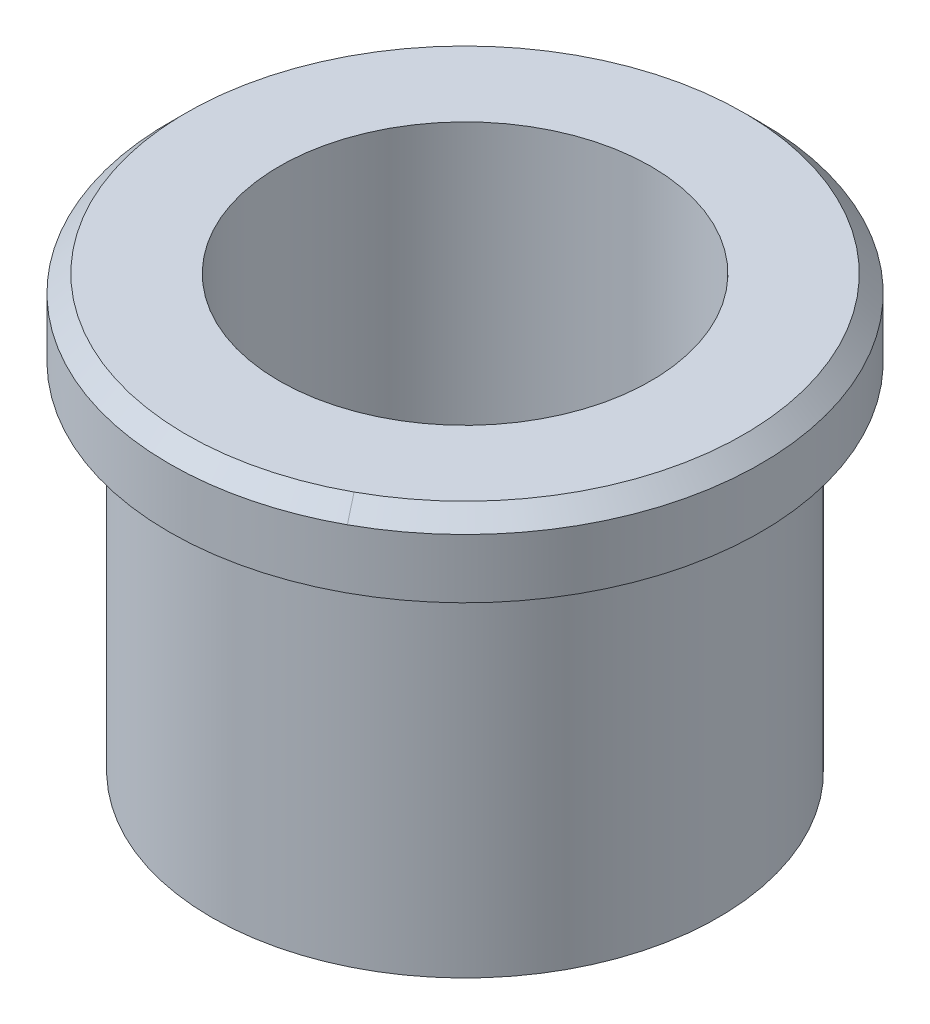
ISO-10303-21;
HEADER;
FILE_DESCRIPTION(('STEP AP214'),'2;1');
FILE_NAME('part.step','',(''),(''),'','','');
FILE_SCHEMA(('AUTOMOTIVE_DESIGN { 1 0 10303 214 1 1 1 1 }'));
ENDSEC;
DATA;
#1=APPLICATION_CONTEXT('core data for automotive mechanical design processes');
#2=APPLICATION_PROTOCOL_DEFINITION('international standard','automotive_design',2000,#1);
#3=PRODUCT_CONTEXT('',#1,'mechanical');
#4=PRODUCT('Part','Part','',(#3));
#5=PRODUCT_RELATED_PRODUCT_CATEGORY('part','',(#4));
#6=PRODUCT_DEFINITION_FORMATION('','',#4);
#7=PRODUCT_DEFINITION_CONTEXT('part definition',#1,'design');
#8=PRODUCT_DEFINITION('design','',#6,#7);
#9=PRODUCT_DEFINITION_SHAPE('','',#8);
#10=(LENGTH_UNIT() NAMED_UNIT(*) SI_UNIT(.MILLI.,.METRE.));
#11=(NAMED_UNIT(*) PLANE_ANGLE_UNIT() SI_UNIT($,.RADIAN.));
#12=(NAMED_UNIT(*) SI_UNIT($,.STERADIAN.) SOLID_ANGLE_UNIT());
#13=UNCERTAINTY_MEASURE_WITH_UNIT(LENGTH_MEASURE(1.E-05),#10,'distance_accuracy_value','');
#14=(GEOMETRIC_REPRESENTATION_CONTEXT(3) GLOBAL_UNCERTAINTY_ASSIGNED_CONTEXT((#13)) GLOBAL_UNIT_ASSIGNED_CONTEXT((#10,
#11,#12)) REPRESENTATION_CONTEXT('',''));
#15=CARTESIAN_POINT('',(0.,0.,0.));
#16=DIRECTION('',(0.,0.,1.));
#17=DIRECTION('',(1.,0.,0.));
#18=AXIS2_PLACEMENT_3D('',#15,#16,#17);
#19=CARTESIAN_POINT('',(0.,-1.00000000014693,0.));
#20=DIRECTION('',(0.,-1.,0.));
#21=DIRECTION('',(1.,0.,0.));
#22=AXIS2_PLACEMENT_3D('',#19,#20,#21);
#23=CONICAL_SURFACE('',#22,17.5000000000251,0.785398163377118);
#24=DIRECTION('',(-0.339005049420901,0.707106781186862,-0.620544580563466));
#25=VECTOR('',#24,1.);
#26=CARTESIAN_POINT('',(239241.254284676,-499000.,437928.178495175));
#27=LINE('',#26,#25);
#28=CARTESIAN_POINT('',(7.91052138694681,4.68652894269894E-11,14.4801122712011));
#29=VERTEX_POINT('',#28);
#30=CARTESIAN_POINT('',(8.38994692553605,-0.999999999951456,15.357694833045));
#31=VERTEX_POINT('',#30);
#32=EDGE_CURVE('E42',#29,#31,#27,.F.);
#33=ORIENTED_EDGE('',*,*,#32,.F.);
#34=CARTESIAN_POINT('',(0.,0.,0.));
#35=DIRECTION('',(0.,-1.,0.));
#36=DIRECTION('',(1.,0.,0.));
#37=AXIS2_PLACEMENT_3D('',#34,#35,#36);
#38=CIRCLE('',#37,16.4999999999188);
#39=CARTESIAN_POINT('',(-7.91052085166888,2.8421709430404E-11,-14.4801125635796));
#40=VERTEX_POINT('',#39);
#41=EDGE_CURVE('E20',#40,#29,#38,.F.);
#42=ORIENTED_EDGE('',*,*,#41,.F.);
#43=CARTESIAN_POINT('',(-8.38994692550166,-0.999999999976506,-15.3576948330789));
#44=CARTESIAN_POINT('',(-8.36997083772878,-0.958333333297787,-15.321128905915));
#45=CARTESIAN_POINT('',(-8.34999475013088,-0.916666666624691,-15.2845629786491));
#46=CARTESIAN_POINT('',(-8.31004257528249,-0.833333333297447,-15.2114311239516));
#47=CARTESIAN_POINT('',(-8.29006648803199,-0.791666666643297,-15.1748651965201));
#48=CARTESIAN_POINT('',(-8.25011431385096,-0.70833333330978,-15.1017333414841));
#49=CARTESIAN_POINT('',(-8.23013822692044,-0.666666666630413,-15.0651674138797));
#50=CARTESIAN_POINT('',(-8.19018605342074,-0.583333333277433,-14.9920355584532));
#51=CARTESIAN_POINT('',(-8.17020996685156,-0.54166666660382,-14.9554696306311));
#52=CARTESIAN_POINT('',(-8.13025779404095,-0.458333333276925,-14.8823377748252));
#53=CARTESIAN_POINT('',(-8.11028170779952,-0.416666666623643,-14.8457718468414));
#54=CARTESIAN_POINT('',(-8.07032953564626,-0.333333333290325,-14.7726399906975));
#55=CARTESIAN_POINT('',(-8.05035344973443,-0.291666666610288,-14.7360740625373));
#56=CARTESIAN_POINT('',(-8.01040127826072,-0.208333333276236,-14.662942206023));
#57=CARTESIAN_POINT('',(-7.99042519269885,-0.166666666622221,-14.6263762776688));
#58=CARTESIAN_POINT('',(-7.95047302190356,-0.0833333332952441,-14.5532444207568));
#59=CARTESIAN_POINT('',(-7.93049693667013,-0.0416666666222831,-14.516678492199));
#60=CARTESIAN_POINT('',(-7.91052085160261,5.67046409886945E-11,-14.4801125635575));
#61=B_SPLINE_CURVE_WITH_KNOTS('',3,(#43,#44,#45,#46,#47,#48,#49,#50,#51,#52,#53,#54,#55,#56,#57,
#58,#59,#60),.UNSPECIFIED.,.F.,.F.,(4,2,2,2,2,2,2,2,4),(0.,0.176776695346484,0.353553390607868,
0.530330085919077,0.707106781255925,0.883883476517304,1.06066017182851,1.2374368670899,
1.41421356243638),.UNSPECIFIED.);
#62=CARTESIAN_POINT('',(-8.38994692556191,-0.999999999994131,-15.3576948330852));
#63=VERTEX_POINT('',#62);
#64=EDGE_CURVE('E35',#63,#40,#61,.T.);
#65=ORIENTED_EDGE('',*,*,#64,.F.);
#66=CARTESIAN_POINT('',(0.,-1.,0.));
#67=DIRECTION('',(0.,1.,0.));
#68=DIRECTION('',(0.,0.,1.));
#69=AXIS2_PLACEMENT_3D('',#66,#67,#68);
#70=CIRCLE('',#69,17.5);
#71=EDGE_CURVE('E44',#31,#63,#70,.F.);
#72=ORIENTED_EDGE('',*,*,#71,.F.);
#73=EDGE_LOOP('',(#33,#42,#65,#72));
#74=FACE_BOUND('',#73,.T.);
#75=ADVANCED_FACE('F16',(#74),#23,.T.);
#76=CARTESIAN_POINT('',(0.,-0.999999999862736,0.));
#77=DIRECTION('',(0.,-1.,0.));
#78=DIRECTION('',(1.,0.,0.));
#79=AXIS2_PLACEMENT_3D('',#76,#77,#78);
#80=CONICAL_SURFACE('',#79,17.499999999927,0.785398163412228);
#81=ORIENTED_EDGE('',*,*,#64,.T.);
#82=CARTESIAN_POINT('',(0.,3.67622599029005E-11,0.));
#83=DIRECTION('',(0.,-1.,0.));
#84=DIRECTION('',(1.,0.,0.));
#85=AXIS2_PLACEMENT_3D('',#82,#83,#84);
#86=CIRCLE('',#85,16.4999999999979);
#87=EDGE_CURVE('E50',#29,#40,#86,.F.);
#88=ORIENTED_EDGE('',*,*,#87,.F.);
#89=ORIENTED_EDGE('',*,*,#32,.T.);
#90=CARTESIAN_POINT('',(0.,-1.,0.));
#91=DIRECTION('',(0.,1.,0.));
#92=DIRECTION('',(0.,0.,1.));
#93=AXIS2_PLACEMENT_3D('',#90,#91,#92);
#94=CIRCLE('',#93,17.5);
#95=EDGE_CURVE('E76',#63,#31,#94,.F.);
#96=ORIENTED_EDGE('',*,*,#95,.F.);
#97=EDGE_LOOP('',(#81,#88,#89,#96));
#98=FACE_BOUND('',#97,.T.);
#99=ADVANCED_FACE('F51',(#98),#80,.T.);
#100=CARTESIAN_POINT('',(0.,0.,11.));
#101=DIRECTION('',(0.,1.,0.));
#102=DIRECTION('',(0.,0.,1.));
#103=AXIS2_PLACEMENT_3D('',#100,#101,#102);
#104=PLANE('',#103);
#105=CARTESIAN_POINT('',(0.,0.,0.));
#106=DIRECTION('',(0.,1.,0.));
#107=DIRECTION('',(0.,0.,1.));
#108=AXIS2_PLACEMENT_3D('',#105,#106,#107);
#109=CIRCLE('',#108,11.);
#110=CARTESIAN_POINT('',(0.,0.,11.));
#111=VERTEX_POINT('',#110);
#112=EDGE_CURVE('E78',#111,#111,#109,.F.);
#113=ORIENTED_EDGE('',*,*,#112,.T.);
#114=EDGE_LOOP('',(#113));
#115=FACE_BOUND('',#114,.T.);
#116=ORIENTED_EDGE('',*,*,#41,.T.);
#117=ORIENTED_EDGE('',*,*,#87,.T.);
#118=EDGE_LOOP('',(#116,#117));
#119=FACE_BOUND('',#118,.T.);
#120=ADVANCED_FACE('F53',(#115,#119),#104,.T.);
#121=CARTESIAN_POINT('',(0.,-12.75,0.));
#122=DIRECTION('',(0.,1.,0.));
#123=DIRECTION('',(0.,0.,1.));
#124=AXIS2_PLACEMENT_3D('',#121,#122,#123);
#125=CYLINDRICAL_SURFACE('',#124,17.5);
#126=CARTESIAN_POINT('',(0.,-4.5,0.));
#127=DIRECTION('',(0.,1.,0.));
#128=DIRECTION('',(0.,0.,1.));
#129=AXIS2_PLACEMENT_3D('',#126,#127,#128);
#130=CIRCLE('',#129,17.5);
#131=CARTESIAN_POINT('',(0.,-4.5,17.5));
#132=VERTEX_POINT('',#131);
#133=EDGE_CURVE('E81',#132,#132,#130,.T.);
#134=ORIENTED_EDGE('',*,*,#133,.T.);
#135=EDGE_LOOP('',(#134));
#136=FACE_BOUND('',#135,.T.);
#137=ORIENTED_EDGE('',*,*,#95,.T.);
#138=ORIENTED_EDGE('',*,*,#71,.T.);
#139=EDGE_LOOP('',(#137,#138));
#140=FACE_BOUND('',#139,.T.);
#141=ADVANCED_FACE('F104',(#136,#140),#125,.T.);
#142=CARTESIAN_POINT('',(0.,-12.75,0.));
#143=DIRECTION('',(0.,1.,0.));
#144=DIRECTION('',(0.,0.,1.));
#145=AXIS2_PLACEMENT_3D('',#142,#143,#144);
#146=CYLINDRICAL_SURFACE('',#145,11.);
#147=ORIENTED_EDGE('',*,*,#112,.F.);
#148=EDGE_LOOP('',(#147));
#149=FACE_BOUND('',#148,.T.);
#150=CARTESIAN_POINT('',(0.,-25.5,0.));
#151=DIRECTION('',(0.,1.,0.));
#152=DIRECTION('',(0.,0.,1.));
#153=AXIS2_PLACEMENT_3D('',#150,#151,#152);
#154=CIRCLE('',#153,11.);
#155=CARTESIAN_POINT('',(0.,-25.5,11.));
#156=VERTEX_POINT('',#155);
#157=EDGE_CURVE('E86',#156,#156,#154,.F.);
#158=ORIENTED_EDGE('',*,*,#157,.T.);
#159=EDGE_LOOP('',(#158));
#160=FACE_BOUND('',#159,.T.);
#161=ADVANCED_FACE('F100',(#149,#160),#146,.F.);
#162=CARTESIAN_POINT('',(0.,-4.5,17.5));
#163=DIRECTION('',(0.,1.,0.));
#164=DIRECTION('',(0.,0.,1.));
#165=AXIS2_PLACEMENT_3D('',#162,#163,#164);
#166=PLANE('',#165);
#167=CARTESIAN_POINT('',(0.,-4.5,0.));
#168=DIRECTION('',(0.,1.,0.));
#169=DIRECTION('',(0.,0.,1.));
#170=AXIS2_PLACEMENT_3D('',#167,#168,#169);
#171=CIRCLE('',#170,15.);
#172=CARTESIAN_POINT('',(0.,-4.5,15.));
#173=VERTEX_POINT('',#172);
#174=EDGE_CURVE('E26',#173,#173,#171,.F.);
#175=ORIENTED_EDGE('',*,*,#174,.F.);
#176=EDGE_LOOP('',(#175));
#177=FACE_BOUND('',#176,.T.);
#178=ORIENTED_EDGE('',*,*,#133,.F.);
#179=EDGE_LOOP('',(#178));
#180=FACE_BOUND('',#179,.T.);
#181=ADVANCED_FACE('F96',(#177,#180),#166,.F.);
#182=CARTESIAN_POINT('',(0.,-25.5,15.));
#183=DIRECTION('',(0.,1.,0.));
#184=DIRECTION('',(0.,0.,1.));
#185=AXIS2_PLACEMENT_3D('',#182,#183,#184);
#186=PLANE('',#185);
#187=ORIENTED_EDGE('',*,*,#157,.F.);
#188=EDGE_LOOP('',(#187));
#189=FACE_BOUND('',#188,.T.);
#190=CARTESIAN_POINT('',(0.,-25.5,0.));
#191=DIRECTION('',(0.,1.,0.));
#192=DIRECTION('',(0.,0.,1.));
#193=AXIS2_PLACEMENT_3D('',#190,#191,#192);
#194=CIRCLE('',#193,15.);
#195=CARTESIAN_POINT('',(0.,-25.5,15.));
#196=VERTEX_POINT('',#195);
#197=EDGE_CURVE('E11',#196,#196,#194,.T.);
#198=ORIENTED_EDGE('',*,*,#197,.F.);
#199=EDGE_LOOP('',(#198));
#200=FACE_BOUND('',#199,.T.);
#201=ADVANCED_FACE('F99',(#189,#200),#186,.F.);
#202=CARTESIAN_POINT('',(0.,-12.75,0.));
#203=DIRECTION('',(0.,1.,0.));
#204=DIRECTION('',(0.,0.,1.));
#205=AXIS2_PLACEMENT_3D('',#202,#203,#204);
#206=CYLINDRICAL_SURFACE('',#205,15.);
#207=ORIENTED_EDGE('',*,*,#197,.T.);
#208=EDGE_LOOP('',(#207));
#209=FACE_BOUND('',#208,.T.);
#210=ORIENTED_EDGE('',*,*,#174,.T.);
#211=EDGE_LOOP('',(#210));
#212=FACE_BOUND('',#211,.T.);
#213=ADVANCED_FACE('F18',(#209,#212),#206,.T.);
#214=CLOSED_SHELL('',(#75,#99,#120,#141,#161,#181,#201,#213));
#215=MANIFOLD_SOLID_BREP('B1',#214);
#216=ADVANCED_BREP_SHAPE_REPRESENTATION('',(#18,#215),#14);
#217=SHAPE_DEFINITION_REPRESENTATION(#9,#216);
ENDSEC;
END-ISO-10303-21;
